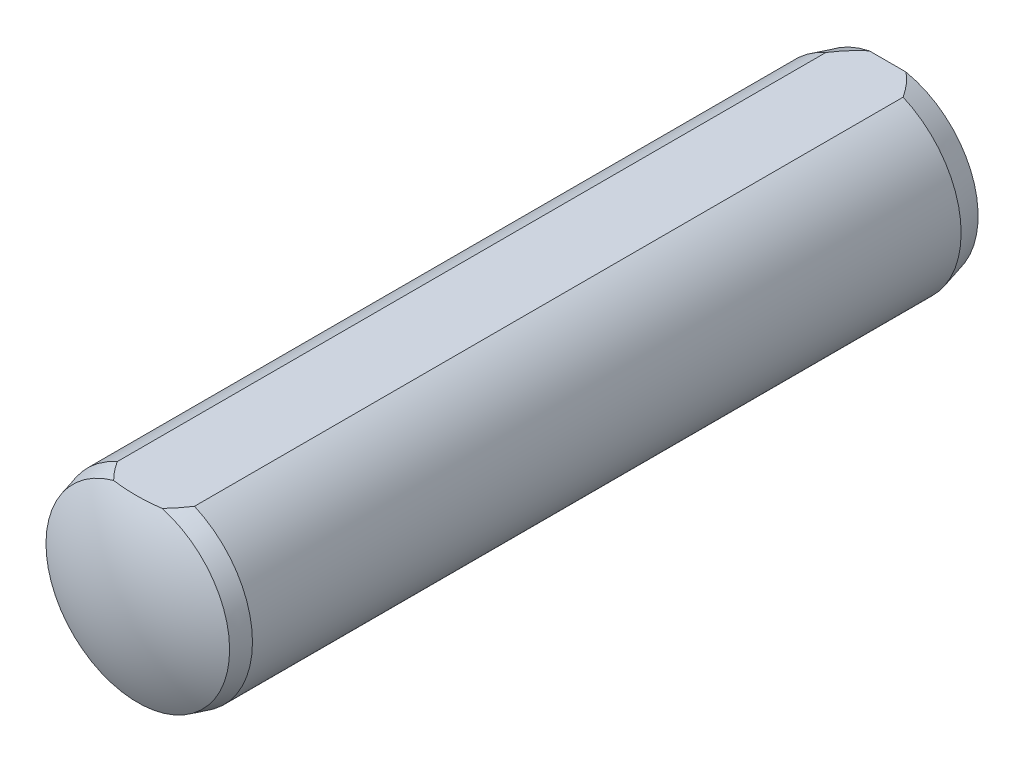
from build123d import *

# Parameters (mm, degrees)
CUT_EXTRUDE1_DEPTH = 21.310096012


with BuildPart() as part:
    # Sketch1 → Revolve1 (revolve)
    with BuildSketch(Plane(origin=(0, 0, 0), x_dir=(0, 0, -1), z_dir=(1, 0, 0)), mode=Mode.PRIVATE) as revolve1_sk:
        with BuildLine():
            Line((-20, 0), (-6.4, 0))
            Line((-6.4, 0), (-5.678312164, 1.25))
            Line((-5.678312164, 1.25), (-6, 1.25))
            Line((-6, 1.25), (-6, 1.5))
            Line((-6, 1.5), (-1.08660254, 1.5))
            Line((-1.08660254, 1.5), (-1, 1.65))
            Line((-1, 1.65), (0, 1.65))
            Line((0, 1.65), (0, 2.339230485))
            Line((0, 2.339230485), (-0.6, 2.5))
            Line((-0.6, 2.5), (-18.933002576, 2.5))
            Line((-18.933002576, 2.5), (-19.4, 2.374868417))
            ThreePointArc((-19.4, 2.374868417), (-19.847679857, 1.224744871), (-20, 0))
        make_face()
    revolve(revolve1_sk.sketch.rotate(Axis((0, 0, 6.4), (0, 0, -1)), 90), axis=Axis((0, 0, 6.4), (0, 0, -1)))

    # Sketch2 → Cut-Extrude1 (cut, through all)
    with BuildSketch(Plane(origin=(0, 0, 0), x_dir=(-1, 0, 0), z_dir=(0, 0, -1))):
        with BuildLine():
            Line((-1, 2.291287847), (1, 2.291287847))
            ThreePointArc((1, 2.291287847), (0, 2.5), (-1, 2.291287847))
        make_face()
    extrude(amount=-CUT_EXTRUDE1_DEPTH, mode=Mode.SUBTRACT)


solid = part.part
